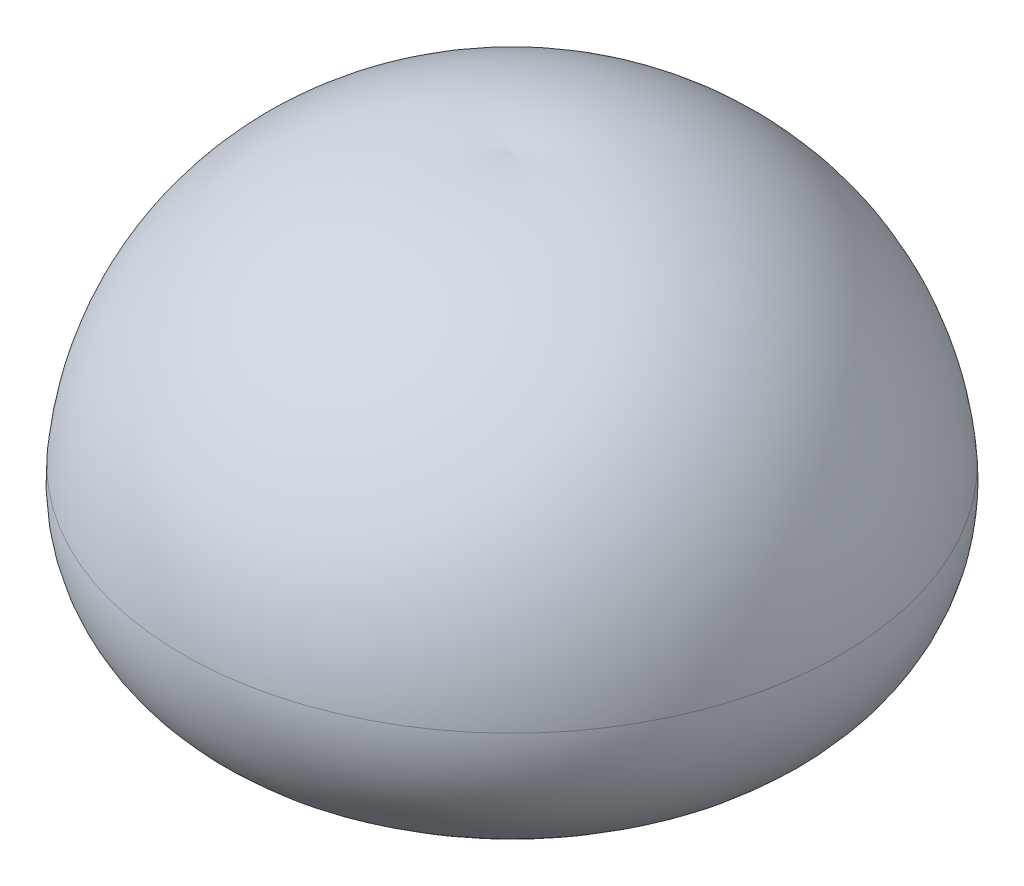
ISO-10303-21;
HEADER;
FILE_DESCRIPTION(('STEP AP214'),'2;1');
FILE_NAME('part.step','',(''),(''),'','','');
FILE_SCHEMA(('AUTOMOTIVE_DESIGN { 1 0 10303 214 1 1 1 1 }'));
ENDSEC;
DATA;
#1=APPLICATION_CONTEXT('core data for automotive mechanical design processes');
#2=APPLICATION_PROTOCOL_DEFINITION('international standard','automotive_design',2000,#1);
#3=PRODUCT_CONTEXT('',#1,'mechanical');
#4=PRODUCT('Part','Part','',(#3));
#5=PRODUCT_RELATED_PRODUCT_CATEGORY('part','',(#4));
#6=PRODUCT_DEFINITION_FORMATION('','',#4);
#7=PRODUCT_DEFINITION_CONTEXT('part definition',#1,'design');
#8=PRODUCT_DEFINITION('design','',#6,#7);
#9=PRODUCT_DEFINITION_SHAPE('','',#8);
#10=(LENGTH_UNIT() NAMED_UNIT(*) SI_UNIT(.MILLI.,.METRE.));
#11=(NAMED_UNIT(*) PLANE_ANGLE_UNIT() SI_UNIT($,.RADIAN.));
#12=(NAMED_UNIT(*) SI_UNIT($,.STERADIAN.) SOLID_ANGLE_UNIT());
#13=UNCERTAINTY_MEASURE_WITH_UNIT(LENGTH_MEASURE(1.E-05),#10,'distance_accuracy_value','');
#14=(GEOMETRIC_REPRESENTATION_CONTEXT(3) GLOBAL_UNCERTAINTY_ASSIGNED_CONTEXT((#13)) GLOBAL_UNIT_ASSIGNED_CONTEXT((#10,
#11,#12)) REPRESENTATION_CONTEXT('',''));
#15=CARTESIAN_POINT('',(0.,0.,0.));
#16=DIRECTION('',(0.,0.,1.));
#17=DIRECTION('',(1.,0.,0.));
#18=AXIS2_PLACEMENT_3D('',#15,#16,#17);
#19=CARTESIAN_POINT('',(1.11022302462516E-13,1337.50000000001,0.));
#20=DIRECTION('',(0.,-1.,0.));
#21=DIRECTION('',(1.,0.,0.));
#22=AXIS2_PLACEMENT_3D('',#19,#20,#21);
#23=DEGENERATE_TOROIDAL_SURFACE('',#22,899.445184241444,1424.11375950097,.F.);
#24=CARTESIAN_POINT('',(1.15022583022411E-13,1043.19012206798,0.));
#25=DIRECTION('',(0.,-1.,0.));
#26=DIRECTION('',(1.,0.,0.));
#27=AXIS2_PLACEMENT_3D('',#24,#25,#26);
#28=CIRCLE('',#27,493.925439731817);
#29=CARTESIAN_POINT('',(493.925439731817,1043.19012206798,0.));
#30=VERTEX_POINT('',#29);
#31=EDGE_CURVE('E41',#30,#30,#28,.T.);
#32=ORIENTED_EDGE('',*,*,#31,.T.);
#33=EDGE_LOOP('',(#32));
#34=FACE_BOUND('',#33,.T.);
#35=CARTESIAN_POINT('',(-5.54481802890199E-12,1906.50358009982,0.));
#36=DIRECTION('',(0.,-1.,0.));
#37=DIRECTION('',(1.,0.,0.));
#38=AXIS2_PLACEMENT_3D('',#35,#36,#37);
#39=CIRCLE('',#38,406.056606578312);
#40=CARTESIAN_POINT('',(406.056606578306,1906.50358009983,0.));
#41=VERTEX_POINT('',#40);
#42=EDGE_CURVE('E11',#41,#41,#39,.T.);
#43=ORIENTED_EDGE('',*,*,#42,.F.);
#44=EDGE_LOOP('',(#43));
#45=FACE_BOUND('',#44,.T.);
#46=ADVANCED_FACE('F34',(#34,#45),#23,.T.);
#47=CARTESIAN_POINT('',(1.11022302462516E-13,645.,0.));
#48=DIRECTION('',(0.,-1.,0.));
#49=DIRECTION('',(1.,0.,0.));
#50=AXIS2_PLACEMENT_3D('',#47,#48,#49);
#51=DEGENERATE_TOROIDAL_SURFACE('',#50,300.,442.902302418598,.T.);
#52=ORIENTED_EDGE('',*,*,#31,.F.);
#53=EDGE_LOOP('',(#52));
#54=FACE_BOUND('',#53,.T.);
#55=CARTESIAN_POINT('',(1.45573968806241E-13,207.590684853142,0.));
#56=DIRECTION('',(0.,-1.,0.));
#57=DIRECTION('',(1.,0.,0.));
#58=AXIS2_PLACEMENT_3D('',#55,#56,#57);
#59=CIRCLE('',#58,369.538050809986);
#60=CARTESIAN_POINT('',(369.538050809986,207.590684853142,0.));
#61=VERTEX_POINT('',#60);
#62=EDGE_CURVE('E64',#61,#61,#59,.T.);
#63=ORIENTED_EDGE('',*,*,#62,.T.);
#64=EDGE_LOOP('',(#63));
#65=FACE_BOUND('',#64,.T.);
#66=ADVANCED_FACE('F55',(#54,#65),#51,.F.);
#67=CARTESIAN_POINT('',(0.,765.710703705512,0.));
#68=DIRECTION('',(0.,-1.,0.));
#69=DIRECTION('',(1.,0.,0.));
#70=AXIS2_PLACEMENT_3D('',#67,#68,#69);
#71=TOROIDAL_SURFACE('',#70,1679.72965685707,1424.11375950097);
#72=ORIENTED_EDGE('',*,*,#62,.F.);
#73=EDGE_LOOP('',(#72));
#74=FACE_BOUND('',#73,.T.);
#75=CARTESIAN_POINT('',(1.2062975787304E-13,889.830396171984,0.));
#76=DIRECTION('',(0.,-1.,0.));
#77=DIRECTION('',(1.,0.,0.));
#78=AXIS2_PLACEMENT_3D('',#75,#76,#77);
#79=CIRCLE('',#78,3098.42423355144);
#80=CARTESIAN_POINT('',(3098.42423355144,889.830396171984,0.));
#81=VERTEX_POINT('',#80);
#82=EDGE_CURVE('E66',#81,#81,#79,.T.);
#83=ORIENTED_EDGE('',*,*,#82,.T.);
#84=EDGE_LOOP('',(#83));
#85=FACE_BOUND('',#84,.T.);
#86=ADVANCED_FACE('F60',(#74,#85),#71,.T.);
#87=CARTESIAN_POINT('',(300.,645.,0.));
#88=DIRECTION('',(0.,0.,-1.));
#89=DIRECTION('',(1.,0.,0.));
#90=AXIS2_PLACEMENT_3D('',#87,#88,#89);
#91=CIRCLE('',#90,2809.11375950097);
#92=TRIMMED_CURVE('',#91,(PARAMETER_VALUE(-1.67779562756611)),
(PARAMETER_VALUE(1.67779562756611)),.T.,.PARAMETER.);
#93=CARTESIAN_POINT('',(1.11022302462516E-13,645.,0.));
#94=DIRECTION('',(0.,-1.,0.));
#95=AXIS1_PLACEMENT('',#93,#94);
#96=SURFACE_OF_REVOLUTION('',#92,#95);
#97=CARTESIAN_POINT('',(-3.14433690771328E-13,3438.04853409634,0.));
#98=VERTEX_POINT('',#97);
#99=VERTEX_LOOP('',#98);
#100=FACE_BOUND('',#99,.T.);
#101=ORIENTED_EDGE('',*,*,#82,.F.);
#102=EDGE_LOOP('',(#101));
#103=FACE_BOUND('',#102,.T.);
#104=ADVANCED_FACE('F50',(#100,#103),#96,.T.);
#105=CARTESIAN_POINT('',(-300.,645.,0.));
#106=DIRECTION('',(0.,0.,-1.));
#107=DIRECTION('',(1.,0.,0.));
#108=AXIS2_PLACEMENT_3D('',#105,#106,#107);
#109=CIRCLE('',#108,1445.65113851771);
#110=TRIMMED_CURVE('',#109,(PARAMETER_VALUE(-1.36175831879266)),
(PARAMETER_VALUE(1.36175831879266)),.T.,.PARAMETER.);
#111=CARTESIAN_POINT('',(6.99440505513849E-12,645.,0.));
#112=DIRECTION('',(0.,-1.,0.));
#113=AXIS1_PLACEMENT('',#111,#112);
#114=SURFACE_OF_REVOLUTION('',#110,#113);
#115=CARTESIAN_POINT('',(-6.91316690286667E-12,2059.18075729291,0.));
#116=VERTEX_POINT('',#115);
#117=VERTEX_LOOP('',#116);
#118=FACE_BOUND('',#117,.T.);
#119=ORIENTED_EDGE('',*,*,#42,.T.);
#120=EDGE_LOOP('',(#119));
#121=FACE_BOUND('',#120,.T.);
#122=ADVANCED_FACE('F47',(#118,#121),#114,.F.);
#123=CLOSED_SHELL('',(#46,#66,#86,#104,#122));
#124=MANIFOLD_SOLID_BREP('B2',#123);
#125=ADVANCED_BREP_SHAPE_REPRESENTATION('',(#18,#124),#14);
#126=SHAPE_DEFINITION_REPRESENTATION(#9,#125);
ENDSEC;
END-ISO-10303-21;
